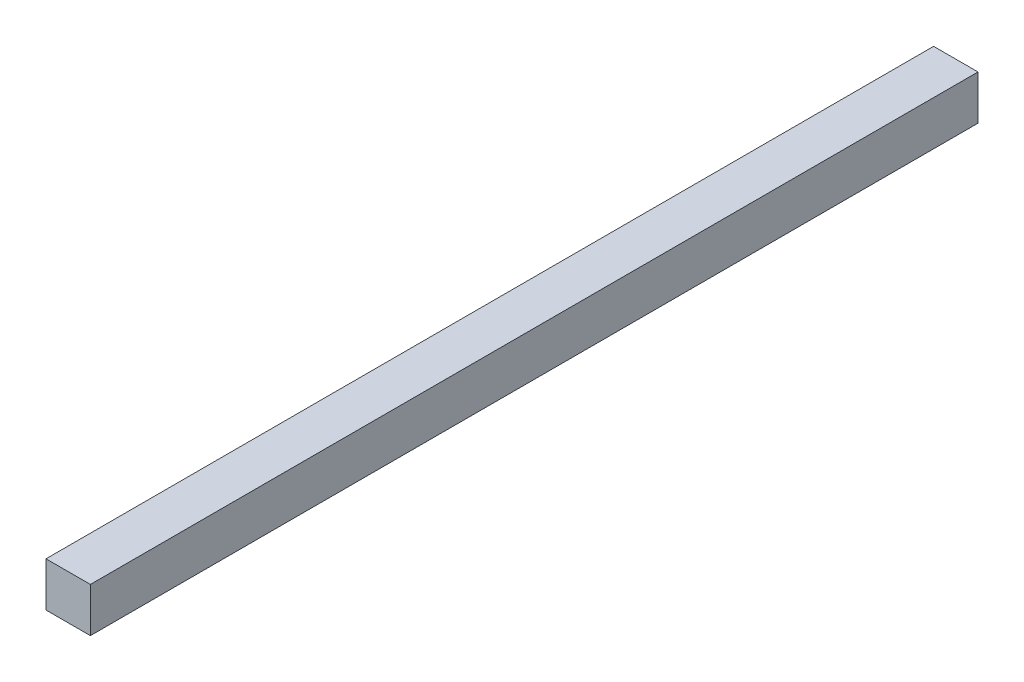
ISO-10303-21;
HEADER;
FILE_DESCRIPTION(('STEP AP214'),'2;1');
FILE_NAME('part.step','',(''),(''),'','','');
FILE_SCHEMA(('AUTOMOTIVE_DESIGN { 1 0 10303 214 1 1 1 1 }'));
ENDSEC;
DATA;
#1=APPLICATION_CONTEXT('core data for automotive mechanical design processes');
#2=APPLICATION_PROTOCOL_DEFINITION('international standard','automotive_design',2000,#1);
#3=PRODUCT_CONTEXT('',#1,'mechanical');
#4=PRODUCT('Part','Part','',(#3));
#5=PRODUCT_RELATED_PRODUCT_CATEGORY('part','',(#4));
#6=PRODUCT_DEFINITION_FORMATION('','',#4);
#7=PRODUCT_DEFINITION_CONTEXT('part definition',#1,'design');
#8=PRODUCT_DEFINITION('design','',#6,#7);
#9=PRODUCT_DEFINITION_SHAPE('','',#8);
#10=(LENGTH_UNIT() NAMED_UNIT(*) SI_UNIT(.MILLI.,.METRE.));
#11=(NAMED_UNIT(*) PLANE_ANGLE_UNIT() SI_UNIT($,.RADIAN.));
#12=(NAMED_UNIT(*) SI_UNIT($,.STERADIAN.) SOLID_ANGLE_UNIT());
#13=UNCERTAINTY_MEASURE_WITH_UNIT(LENGTH_MEASURE(1.E-05),#10,'distance_accuracy_value','');
#14=(GEOMETRIC_REPRESENTATION_CONTEXT(3) GLOBAL_UNCERTAINTY_ASSIGNED_CONTEXT((#13)) GLOBAL_UNIT_ASSIGNED_CONTEXT((#10,
#11,#12)) REPRESENTATION_CONTEXT('',''));
#15=CARTESIAN_POINT('',(0.,0.,0.));
#16=DIRECTION('',(0.,0.,1.));
#17=DIRECTION('',(1.,0.,0.));
#18=AXIS2_PLACEMENT_3D('',#15,#16,#17);
#19=CARTESIAN_POINT('',(-6.35,0.,127.));
#20=DIRECTION('',(1.,0.,0.));
#21=DIRECTION('',(0.,1.,0.));
#22=AXIS2_PLACEMENT_3D('',#19,#20,#21);
#23=PLANE('',#22);
#24=DIRECTION('',(0.,-1.,0.));
#25=VECTOR('',#24,1.);
#26=CARTESIAN_POINT('',(-6.35,0.,-127.));
#27=LINE('',#26,#25);
#28=CARTESIAN_POINT('',(-6.35,0.,-127.));
#29=VERTEX_POINT('',#28);
#30=CARTESIAN_POINT('',(-6.35,-12.7,-127.));
#31=VERTEX_POINT('',#30);
#32=EDGE_CURVE('E96',#29,#31,#27,.T.);
#33=ORIENTED_EDGE('',*,*,#32,.T.);
#34=DIRECTION('',(0.,0.,-1.));
#35=VECTOR('',#34,1.);
#36=CARTESIAN_POINT('',(-6.35,-12.7,127.));
#37=LINE('',#36,#35);
#38=CARTESIAN_POINT('',(-6.35,-12.7,127.));
#39=VERTEX_POINT('',#38);
#40=EDGE_CURVE('E11',#39,#31,#37,.T.);
#41=ORIENTED_EDGE('',*,*,#40,.F.);
#42=DIRECTION('',(0.,-1.,0.));
#43=VECTOR('',#42,1.);
#44=CARTESIAN_POINT('',(-6.35,0.,127.));
#45=LINE('',#44,#43);
#46=CARTESIAN_POINT('',(-6.35,0.,127.));
#47=VERTEX_POINT('',#46);
#48=EDGE_CURVE('E84',#47,#39,#45,.T.);
#49=ORIENTED_EDGE('',*,*,#48,.F.);
#50=DIRECTION('',(0.,0.,-1.));
#51=VECTOR('',#50,1.);
#52=CARTESIAN_POINT('',(-6.35,0.,127.));
#53=LINE('',#52,#51);
#54=EDGE_CURVE('E92',#47,#29,#53,.T.);
#55=ORIENTED_EDGE('',*,*,#54,.T.);
#56=EDGE_LOOP('',(#33,#41,#49,#55));
#57=FACE_BOUND('',#56,.T.);
#58=ADVANCED_FACE('F33',(#57),#23,.F.);
#59=CARTESIAN_POINT('',(-6.35,-12.7,127.));
#60=DIRECTION('',(0.,1.,0.));
#61=DIRECTION('',(-1.,0.,0.));
#62=AXIS2_PLACEMENT_3D('',#59,#60,#61);
#63=PLANE('',#62);
#64=DIRECTION('',(1.,0.,0.));
#65=VECTOR('',#64,1.);
#66=CARTESIAN_POINT('',(-6.35,-12.7,-127.));
#67=LINE('',#66,#65);
#68=CARTESIAN_POINT('',(6.35,-12.7,-127.));
#69=VERTEX_POINT('',#68);
#70=EDGE_CURVE('E88',#31,#69,#67,.T.);
#71=ORIENTED_EDGE('',*,*,#70,.T.);
#72=DIRECTION('',(0.,0.,-1.));
#73=VECTOR('',#72,1.);
#74=CARTESIAN_POINT('',(6.35,-12.7,127.));
#75=LINE('',#74,#73);
#76=CARTESIAN_POINT('',(6.35,-12.7,127.));
#77=VERTEX_POINT('',#76);
#78=EDGE_CURVE('E41',#77,#69,#75,.T.);
#79=ORIENTED_EDGE('',*,*,#78,.F.);
#80=DIRECTION('',(1.,0.,0.));
#81=VECTOR('',#80,1.);
#82=CARTESIAN_POINT('',(-6.35,-12.7,127.));
#83=LINE('',#82,#81);
#84=EDGE_CURVE('E79',#39,#77,#83,.T.);
#85=ORIENTED_EDGE('',*,*,#84,.F.);
#86=ORIENTED_EDGE('',*,*,#40,.T.);
#87=EDGE_LOOP('',(#71,#79,#85,#86));
#88=FACE_BOUND('',#87,.T.);
#89=ADVANCED_FACE('F87',(#88),#63,.F.);
#90=CARTESIAN_POINT('',(6.35,0.,127.));
#91=DIRECTION('',(-1.,0.,0.));
#92=DIRECTION('',(0.,-1.,0.));
#93=AXIS2_PLACEMENT_3D('',#90,#91,#92);
#94=PLANE('',#93);
#95=DIRECTION('',(0.,1.,0.));
#96=VECTOR('',#95,1.);
#97=CARTESIAN_POINT('',(6.35,0.,-127.));
#98=LINE('',#97,#96);
#99=CARTESIAN_POINT('',(6.35,0.,-127.));
#100=VERTEX_POINT('',#99);
#101=EDGE_CURVE('E66',#69,#100,#98,.T.);
#102=ORIENTED_EDGE('',*,*,#101,.T.);
#103=DIRECTION('',(0.,0.,-1.));
#104=VECTOR('',#103,1.);
#105=CARTESIAN_POINT('',(6.35,0.,127.));
#106=LINE('',#105,#104);
#107=CARTESIAN_POINT('',(6.35,0.,127.));
#108=VERTEX_POINT('',#107);
#109=EDGE_CURVE('E89',#108,#100,#106,.T.);
#110=ORIENTED_EDGE('',*,*,#109,.F.);
#111=DIRECTION('',(0.,1.,0.));
#112=VECTOR('',#111,1.);
#113=CARTESIAN_POINT('',(6.35,0.,127.));
#114=LINE('',#113,#112);
#115=EDGE_CURVE('E82',#77,#108,#114,.T.);
#116=ORIENTED_EDGE('',*,*,#115,.F.);
#117=ORIENTED_EDGE('',*,*,#78,.T.);
#118=EDGE_LOOP('',(#102,#110,#116,#117));
#119=FACE_BOUND('',#118,.T.);
#120=ADVANCED_FACE('F90',(#119),#94,.F.);
#121=CARTESIAN_POINT('',(-6.35,0.,127.));
#122=DIRECTION('',(0.,-1.,0.));
#123=DIRECTION('',(1.,0.,0.));
#124=AXIS2_PLACEMENT_3D('',#121,#122,#123);
#125=PLANE('',#124);
#126=DIRECTION('',(-1.,0.,0.));
#127=VECTOR('',#126,1.);
#128=CARTESIAN_POINT('',(-6.35,0.,-127.));
#129=LINE('',#128,#127);
#130=EDGE_CURVE('E72',#100,#29,#129,.T.);
#131=ORIENTED_EDGE('',*,*,#130,.T.);
#132=ORIENTED_EDGE('',*,*,#54,.F.);
#133=DIRECTION('',(-1.,0.,0.));
#134=VECTOR('',#133,1.);
#135=CARTESIAN_POINT('',(-6.35,0.,127.));
#136=LINE('',#135,#134);
#137=EDGE_CURVE('E49',#108,#47,#136,.T.);
#138=ORIENTED_EDGE('',*,*,#137,.F.);
#139=ORIENTED_EDGE('',*,*,#109,.T.);
#140=EDGE_LOOP('',(#131,#132,#138,#139));
#141=FACE_BOUND('',#140,.T.);
#142=ADVANCED_FACE('F103',(#141),#125,.F.);
#143=CARTESIAN_POINT('',(0.,0.,127.));
#144=DIRECTION('',(0.,0.,1.));
#145=DIRECTION('',(1.,0.,0.));
#146=AXIS2_PLACEMENT_3D('',#143,#144,#145);
#147=PLANE('',#146);
#148=ORIENTED_EDGE('',*,*,#48,.T.);
#149=ORIENTED_EDGE('',*,*,#84,.T.);
#150=ORIENTED_EDGE('',*,*,#115,.T.);
#151=ORIENTED_EDGE('',*,*,#137,.T.);
#152=EDGE_LOOP('',(#148,#149,#150,#151));
#153=FACE_BOUND('',#152,.T.);
#154=ADVANCED_FACE('F80',(#153),#147,.T.);
#155=CARTESIAN_POINT('',(0.,0.,-127.));
#156=DIRECTION('',(0.,0.,1.));
#157=DIRECTION('',(1.,0.,0.));
#158=AXIS2_PLACEMENT_3D('',#155,#156,#157);
#159=PLANE('',#158);
#160=ORIENTED_EDGE('',*,*,#32,.F.);
#161=ORIENTED_EDGE('',*,*,#130,.F.);
#162=ORIENTED_EDGE('',*,*,#101,.F.);
#163=ORIENTED_EDGE('',*,*,#70,.F.);
#164=EDGE_LOOP('',(#160,#161,#162,#163));
#165=FACE_BOUND('',#164,.T.);
#166=ADVANCED_FACE('F106',(#165),#159,.F.);
#167=CLOSED_SHELL('',(#58,#89,#120,#142,#154,#166));
#168=MANIFOLD_SOLID_BREP('B2',#167);
#169=ADVANCED_BREP_SHAPE_REPRESENTATION('',(#18,#168),#14);
#170=SHAPE_DEFINITION_REPRESENTATION(#9,#169);
ENDSEC;
END-ISO-10303-21;
